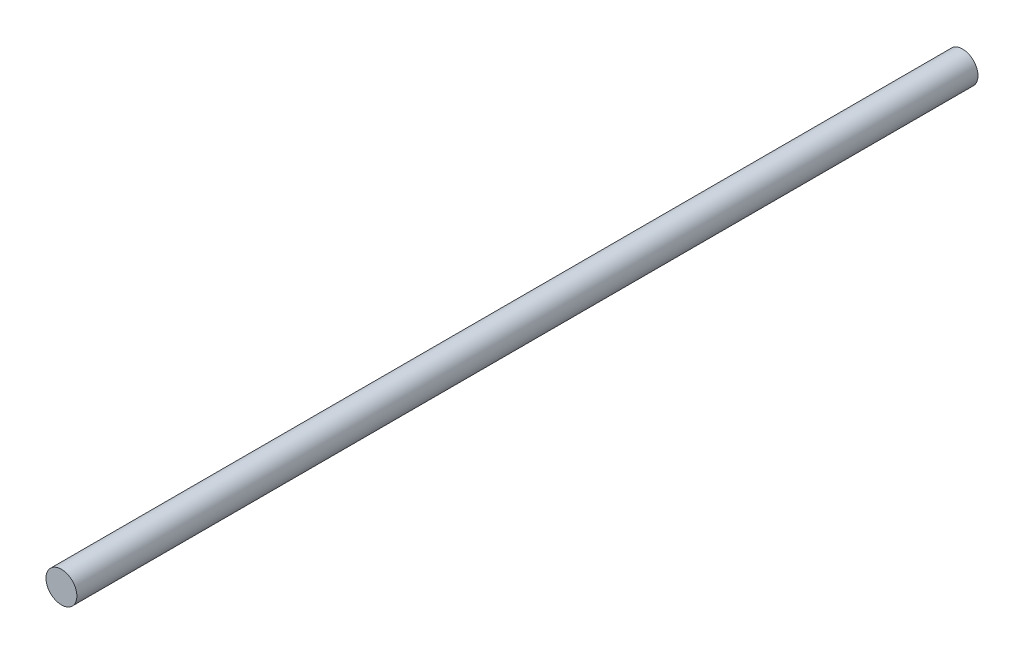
from build123d import *

# Parameters (mm, degrees)
SKETCH1_R           = 30
BOSS_EXTRUDE1_DEPTH = 1750


with BuildPart() as part:
    # Sketch1 → Boss-Extrude1 (new body)
    with BuildSketch(Plane.XY):
        Circle(SKETCH1_R)
    extrude(amount=-BOSS_EXTRUDE1_DEPTH)


solid = part.part
